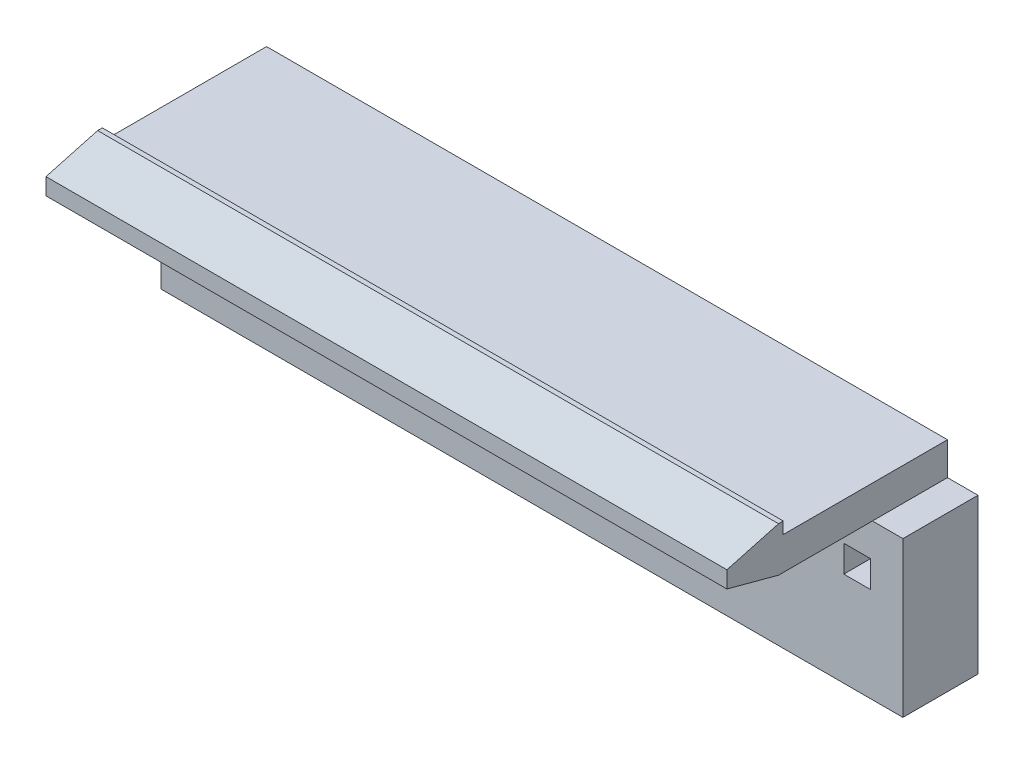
ISO-10303-21;
HEADER;
FILE_DESCRIPTION(('STEP AP214'),'2;1');
FILE_NAME('part.step','',(''),(''),'','','');
FILE_SCHEMA(('AUTOMOTIVE_DESIGN { 1 0 10303 214 1 1 1 1 }'));
ENDSEC;
DATA;
#1=APPLICATION_CONTEXT('core data for automotive mechanical design processes');
#2=APPLICATION_PROTOCOL_DEFINITION('international standard','automotive_design',2000,#1);
#3=PRODUCT_CONTEXT('',#1,'mechanical');
#4=PRODUCT('Part','Part','',(#3));
#5=PRODUCT_RELATED_PRODUCT_CATEGORY('part','',(#4));
#6=PRODUCT_DEFINITION_FORMATION('','',#4);
#7=PRODUCT_DEFINITION_CONTEXT('part definition',#1,'design');
#8=PRODUCT_DEFINITION('design','',#6,#7);
#9=PRODUCT_DEFINITION_SHAPE('','',#8);
#10=(LENGTH_UNIT() NAMED_UNIT(*) SI_UNIT(.MILLI.,.METRE.));
#11=(NAMED_UNIT(*) PLANE_ANGLE_UNIT() SI_UNIT($,.RADIAN.));
#12=(NAMED_UNIT(*) SI_UNIT($,.STERADIAN.) SOLID_ANGLE_UNIT());
#13=UNCERTAINTY_MEASURE_WITH_UNIT(LENGTH_MEASURE(1.E-05),#10,'distance_accuracy_value','');
#14=(GEOMETRIC_REPRESENTATION_CONTEXT(3) GLOBAL_UNCERTAINTY_ASSIGNED_CONTEXT((#13)) GLOBAL_UNIT_ASSIGNED_CONTEXT((#10,
#11,#12)) REPRESENTATION_CONTEXT('',''));
#15=CARTESIAN_POINT('',(0.,0.,0.));
#16=DIRECTION('',(0.,0.,1.));
#17=DIRECTION('',(1.,0.,0.));
#18=AXIS2_PLACEMENT_3D('',#15,#16,#17);
#19=CARTESIAN_POINT('',(0.,0.,9.4));
#20=DIRECTION('',(0.,0.,-1.));
#21=DIRECTION('',(-1.,0.,0.));
#22=AXIS2_PLACEMENT_3D('',#19,#20,#21);
#23=PLANE('',#22);
#24=DIRECTION('',(1.,0.,0.));
#25=VECTOR('',#24,1.);
#26=CARTESIAN_POINT('',(-15.81,2.93948822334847,9.4));
#27=LINE('',#26,#25);
#28=CARTESIAN_POINT('',(-14.51,2.93948822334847,9.4));
#29=VERTEX_POINT('',#28);
#30=CARTESIAN_POINT('',(14.51,2.93948822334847,9.4));
#31=VERTEX_POINT('',#30);
#32=EDGE_CURVE('E330',#29,#31,#27,.T.);
#33=ORIENTED_EDGE('',*,*,#32,.T.);
#34=DIRECTION('',(0.,1.,0.));
#35=VECTOR('',#34,1.);
#36=CARTESIAN_POINT('',(14.51,0.,9.4));
#37=LINE('',#36,#35);
#38=CARTESIAN_POINT('',(14.51,3.65,9.4));
#39=VERTEX_POINT('',#38);
#40=EDGE_CURVE('E19',#39,#31,#37,.F.);
#41=ORIENTED_EDGE('',*,*,#40,.F.);
#42=DIRECTION('',(1.,0.,0.));
#43=VECTOR('',#42,1.);
#44=CARTESIAN_POINT('',(0.,3.65,9.4));
#45=LINE('',#44,#43);
#46=CARTESIAN_POINT('',(-14.51,3.65,9.4));
#47=VERTEX_POINT('',#46);
#48=EDGE_CURVE('E335',#39,#47,#45,.F.);
#49=ORIENTED_EDGE('',*,*,#48,.T.);
#50=DIRECTION('',(0.,1.,0.));
#51=VECTOR('',#50,1.);
#52=CARTESIAN_POINT('',(-14.51,0.,9.4));
#53=LINE('',#52,#51);
#54=EDGE_CURVE('E311',#29,#47,#53,.T.);
#55=ORIENTED_EDGE('',*,*,#54,.F.);
#56=EDGE_LOOP('',(#33,#41,#49,#55));
#57=FACE_BOUND('',#56,.T.);
#58=ADVANCED_FACE('F16',(#57),#23,.F.);
#59=CARTESIAN_POINT('',(13.29,0.919999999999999,0.));
#60=DIRECTION('',(0.,1.,0.));
#61=DIRECTION('',(0.,0.,1.));
#62=AXIS2_PLACEMENT_3D('',#59,#60,#61);
#63=PLANE('',#62);
#64=DIRECTION('',(0.,0.,1.));
#65=VECTOR('',#64,1.);
#66=CARTESIAN_POINT('',(13.29,0.919999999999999,0.));
#67=LINE('',#66,#65);
#68=CARTESIAN_POINT('',(13.29,0.919999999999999,3.2));
#69=VERTEX_POINT('',#68);
#70=CARTESIAN_POINT('',(13.29,0.919999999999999,0.));
#71=VERTEX_POINT('',#70);
#72=EDGE_CURVE('E314',#69,#71,#67,.F.);
#73=ORIENTED_EDGE('',*,*,#72,.T.);
#74=DIRECTION('',(1.,0.,0.));
#75=VECTOR('',#74,1.);
#76=CARTESIAN_POINT('',(13.29,0.919999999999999,0.));
#77=LINE('',#76,#75);
#78=CARTESIAN_POINT('',(14.43,0.919999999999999,0.));
#79=VERTEX_POINT('',#78);
#80=EDGE_CURVE('E301',#79,#71,#77,.F.);
#81=ORIENTED_EDGE('',*,*,#80,.F.);
#82=DIRECTION('',(0.,0.,-1.));
#83=VECTOR('',#82,1.);
#84=CARTESIAN_POINT('',(14.43,0.919999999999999,0.));
#85=LINE('',#84,#83);
#86=CARTESIAN_POINT('',(14.43,0.919999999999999,3.2));
#87=VERTEX_POINT('',#86);
#88=EDGE_CURVE('E325',#79,#87,#85,.F.);
#89=ORIENTED_EDGE('',*,*,#88,.T.);
#90=DIRECTION('',(1.,0.,0.));
#91=VECTOR('',#90,1.);
#92=CARTESIAN_POINT('',(13.29,0.919999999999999,3.2));
#93=LINE('',#92,#91);
#94=EDGE_CURVE('E310',#69,#87,#93,.T.);
#95=ORIENTED_EDGE('',*,*,#94,.F.);
#96=EDGE_LOOP('',(#73,#81,#89,#95));
#97=FACE_BOUND('',#96,.T.);
#98=ADVANCED_FACE('F315',(#97),#63,.F.);
#99=CARTESIAN_POINT('',(9.32999999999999,0.919999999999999,0.));
#100=DIRECTION('',(0.,1.,0.));
#101=DIRECTION('',(0.,0.,1.));
#102=AXIS2_PLACEMENT_3D('',#99,#100,#101);
#103=PLANE('',#102);
#104=DIRECTION('',(0.,0.,1.));
#105=VECTOR('',#104,1.);
#106=CARTESIAN_POINT('',(9.32999999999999,0.919999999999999,0.));
#107=LINE('',#106,#105);
#108=CARTESIAN_POINT('',(9.32999999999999,0.919999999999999,3.2));
#109=VERTEX_POINT('',#108);
#110=CARTESIAN_POINT('',(9.32999999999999,0.919999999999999,0.));
#111=VERTEX_POINT('',#110);
#112=EDGE_CURVE('E468',#109,#111,#107,.F.);
#113=ORIENTED_EDGE('',*,*,#112,.T.);
#114=DIRECTION('',(1.,0.,0.));
#115=VECTOR('',#114,1.);
#116=CARTESIAN_POINT('',(9.32999999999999,0.919999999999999,0.));
#117=LINE('',#116,#115);
#118=CARTESIAN_POINT('',(10.47,0.919999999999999,0.));
#119=VERTEX_POINT('',#118);
#120=EDGE_CURVE('E366',#119,#111,#117,.F.);
#121=ORIENTED_EDGE('',*,*,#120,.F.);
#122=DIRECTION('',(0.,0.,-1.));
#123=VECTOR('',#122,1.);
#124=CARTESIAN_POINT('',(10.47,0.919999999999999,0.));
#125=LINE('',#124,#123);
#126=CARTESIAN_POINT('',(10.47,0.919999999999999,3.2));
#127=VERTEX_POINT('',#126);
#128=EDGE_CURVE('E461',#119,#127,#125,.F.);
#129=ORIENTED_EDGE('',*,*,#128,.T.);
#130=DIRECTION('',(1.,0.,0.));
#131=VECTOR('',#130,1.);
#132=CARTESIAN_POINT('',(9.32999999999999,0.919999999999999,3.2));
#133=LINE('',#132,#131);
#134=EDGE_CURVE('E364',#109,#127,#133,.T.);
#135=ORIENTED_EDGE('',*,*,#134,.F.);
#136=EDGE_LOOP('',(#113,#121,#129,#135));
#137=FACE_BOUND('',#136,.T.);
#138=ADVANCED_FACE('F648',(#137),#103,.F.);
#139=CARTESIAN_POINT('',(5.36999999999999,0.919999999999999,0.));
#140=DIRECTION('',(0.,1.,0.));
#141=DIRECTION('',(0.,0.,1.));
#142=AXIS2_PLACEMENT_3D('',#139,#140,#141);
#143=PLANE('',#142);
#144=DIRECTION('',(0.,0.,1.));
#145=VECTOR('',#144,1.);
#146=CARTESIAN_POINT('',(5.36999999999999,0.919999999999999,0.));
#147=LINE('',#146,#145);
#148=CARTESIAN_POINT('',(5.36999999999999,0.919999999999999,3.2));
#149=VERTEX_POINT('',#148);
#150=CARTESIAN_POINT('',(5.36999999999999,0.919999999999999,0.));
#151=VERTEX_POINT('',#150);
#152=EDGE_CURVE('E458',#149,#151,#147,.F.);
#153=ORIENTED_EDGE('',*,*,#152,.T.);
#154=DIRECTION('',(1.,0.,0.));
#155=VECTOR('',#154,1.);
#156=CARTESIAN_POINT('',(5.36999999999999,0.919999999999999,0.));
#157=LINE('',#156,#155);
#158=CARTESIAN_POINT('',(6.50999999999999,0.919999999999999,0.));
#159=VERTEX_POINT('',#158);
#160=EDGE_CURVE('E362',#159,#151,#157,.F.);
#161=ORIENTED_EDGE('',*,*,#160,.F.);
#162=DIRECTION('',(0.,0.,-1.));
#163=VECTOR('',#162,1.);
#164=CARTESIAN_POINT('',(6.50999999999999,0.919999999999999,0.));
#165=LINE('',#164,#163);
#166=CARTESIAN_POINT('',(6.50999999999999,0.919999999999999,3.2));
#167=VERTEX_POINT('',#166);
#168=EDGE_CURVE('E451',#159,#167,#165,.F.);
#169=ORIENTED_EDGE('',*,*,#168,.T.);
#170=DIRECTION('',(1.,0.,0.));
#171=VECTOR('',#170,1.);
#172=CARTESIAN_POINT('',(5.36999999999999,0.919999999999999,3.2));
#173=LINE('',#172,#171);
#174=EDGE_CURVE('E360',#149,#167,#173,.T.);
#175=ORIENTED_EDGE('',*,*,#174,.F.);
#176=EDGE_LOOP('',(#153,#161,#169,#175));
#177=FACE_BOUND('',#176,.T.);
#178=ADVANCED_FACE('F855',(#177),#143,.F.);
#179=CARTESIAN_POINT('',(1.40999999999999,0.919999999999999,0.));
#180=DIRECTION('',(0.,1.,0.));
#181=DIRECTION('',(0.,0.,1.));
#182=AXIS2_PLACEMENT_3D('',#179,#180,#181);
#183=PLANE('',#182);
#184=DIRECTION('',(0.,0.,1.));
#185=VECTOR('',#184,1.);
#186=CARTESIAN_POINT('',(1.40999999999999,0.919999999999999,0.));
#187=LINE('',#186,#185);
#188=CARTESIAN_POINT('',(1.40999999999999,0.919999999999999,3.2));
#189=VERTEX_POINT('',#188);
#190=CARTESIAN_POINT('',(1.40999999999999,0.919999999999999,0.));
#191=VERTEX_POINT('',#190);
#192=EDGE_CURVE('E448',#189,#191,#187,.F.);
#193=ORIENTED_EDGE('',*,*,#192,.T.);
#194=DIRECTION('',(1.,0.,0.));
#195=VECTOR('',#194,1.);
#196=CARTESIAN_POINT('',(1.40999999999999,0.919999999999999,0.));
#197=LINE('',#196,#195);
#198=CARTESIAN_POINT('',(2.54999999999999,0.919999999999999,0.));
#199=VERTEX_POINT('',#198);
#200=EDGE_CURVE('E358',#199,#191,#197,.F.);
#201=ORIENTED_EDGE('',*,*,#200,.F.);
#202=DIRECTION('',(0.,0.,-1.));
#203=VECTOR('',#202,1.);
#204=CARTESIAN_POINT('',(2.54999999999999,0.919999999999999,0.));
#205=LINE('',#204,#203);
#206=CARTESIAN_POINT('',(2.54999999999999,0.919999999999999,3.2));
#207=VERTEX_POINT('',#206);
#208=EDGE_CURVE('E441',#199,#207,#205,.F.);
#209=ORIENTED_EDGE('',*,*,#208,.T.);
#210=DIRECTION('',(1.,0.,0.));
#211=VECTOR('',#210,1.);
#212=CARTESIAN_POINT('',(1.40999999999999,0.919999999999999,3.2));
#213=LINE('',#212,#211);
#214=EDGE_CURVE('E356',#189,#207,#213,.T.);
#215=ORIENTED_EDGE('',*,*,#214,.F.);
#216=EDGE_LOOP('',(#193,#201,#209,#215));
#217=FACE_BOUND('',#216,.T.);
#218=ADVANCED_FACE('F719',(#217),#183,.F.);
#219=CARTESIAN_POINT('',(-2.55000000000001,0.919999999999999,0.));
#220=DIRECTION('',(0.,1.,0.));
#221=DIRECTION('',(0.,0.,1.));
#222=AXIS2_PLACEMENT_3D('',#219,#220,#221);
#223=PLANE('',#222);
#224=DIRECTION('',(0.,0.,1.));
#225=VECTOR('',#224,1.);
#226=CARTESIAN_POINT('',(-2.55000000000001,0.919999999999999,0.));
#227=LINE('',#226,#225);
#228=CARTESIAN_POINT('',(-2.55000000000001,0.919999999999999,3.2));
#229=VERTEX_POINT('',#228);
#230=CARTESIAN_POINT('',(-2.55000000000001,0.919999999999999,0.));
#231=VERTEX_POINT('',#230);
#232=EDGE_CURVE('E438',#229,#231,#227,.F.);
#233=ORIENTED_EDGE('',*,*,#232,.T.);
#234=DIRECTION('',(1.,0.,0.));
#235=VECTOR('',#234,1.);
#236=CARTESIAN_POINT('',(-2.55000000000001,0.919999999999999,0.));
#237=LINE('',#236,#235);
#238=CARTESIAN_POINT('',(-1.41000000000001,0.919999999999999,0.));
#239=VERTEX_POINT('',#238);
#240=EDGE_CURVE('E354',#239,#231,#237,.F.);
#241=ORIENTED_EDGE('',*,*,#240,.F.);
#242=DIRECTION('',(0.,0.,-1.));
#243=VECTOR('',#242,1.);
#244=CARTESIAN_POINT('',(-1.41000000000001,0.919999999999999,0.));
#245=LINE('',#244,#243);
#246=CARTESIAN_POINT('',(-1.41000000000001,0.919999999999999,3.2));
#247=VERTEX_POINT('',#246);
#248=EDGE_CURVE('E431',#239,#247,#245,.F.);
#249=ORIENTED_EDGE('',*,*,#248,.T.);
#250=DIRECTION('',(1.,0.,0.));
#251=VECTOR('',#250,1.);
#252=CARTESIAN_POINT('',(-2.55000000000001,0.919999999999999,3.2));
#253=LINE('',#252,#251);
#254=EDGE_CURVE('E352',#229,#247,#253,.T.);
#255=ORIENTED_EDGE('',*,*,#254,.F.);
#256=EDGE_LOOP('',(#233,#241,#249,#255));
#257=FACE_BOUND('',#256,.T.);
#258=ADVANCED_FACE('F842',(#257),#223,.F.);
#259=CARTESIAN_POINT('',(-6.51000000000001,0.919999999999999,0.));
#260=DIRECTION('',(0.,1.,0.));
#261=DIRECTION('',(0.,0.,1.));
#262=AXIS2_PLACEMENT_3D('',#259,#260,#261);
#263=PLANE('',#262);
#264=DIRECTION('',(0.,0.,1.));
#265=VECTOR('',#264,1.);
#266=CARTESIAN_POINT('',(-6.51000000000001,0.919999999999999,0.));
#267=LINE('',#266,#265);
#268=CARTESIAN_POINT('',(-6.51000000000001,0.919999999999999,3.2));
#269=VERTEX_POINT('',#268);
#270=CARTESIAN_POINT('',(-6.51000000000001,0.919999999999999,0.));
#271=VERTEX_POINT('',#270);
#272=EDGE_CURVE('E428',#269,#271,#267,.F.);
#273=ORIENTED_EDGE('',*,*,#272,.T.);
#274=DIRECTION('',(1.,0.,0.));
#275=VECTOR('',#274,1.);
#276=CARTESIAN_POINT('',(-6.51000000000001,0.919999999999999,0.));
#277=LINE('',#276,#275);
#278=CARTESIAN_POINT('',(-5.37000000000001,0.919999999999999,0.));
#279=VERTEX_POINT('',#278);
#280=EDGE_CURVE('E350',#279,#271,#277,.F.);
#281=ORIENTED_EDGE('',*,*,#280,.F.);
#282=DIRECTION('',(0.,0.,-1.));
#283=VECTOR('',#282,1.);
#284=CARTESIAN_POINT('',(-5.37000000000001,0.919999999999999,0.));
#285=LINE('',#284,#283);
#286=CARTESIAN_POINT('',(-5.37000000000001,0.919999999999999,3.2));
#287=VERTEX_POINT('',#286);
#288=EDGE_CURVE('E421',#279,#287,#285,.F.);
#289=ORIENTED_EDGE('',*,*,#288,.T.);
#290=DIRECTION('',(1.,0.,0.));
#291=VECTOR('',#290,1.);
#292=CARTESIAN_POINT('',(-6.51000000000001,0.919999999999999,3.2));
#293=LINE('',#292,#291);
#294=EDGE_CURVE('E348',#269,#287,#293,.T.);
#295=ORIENTED_EDGE('',*,*,#294,.F.);
#296=EDGE_LOOP('',(#273,#281,#289,#295));
#297=FACE_BOUND('',#296,.T.);
#298=ADVANCED_FACE('F846',(#297),#263,.F.);
#299=CARTESIAN_POINT('',(-10.47,0.919999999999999,0.));
#300=DIRECTION('',(0.,1.,0.));
#301=DIRECTION('',(0.,0.,1.));
#302=AXIS2_PLACEMENT_3D('',#299,#300,#301);
#303=PLANE('',#302);
#304=DIRECTION('',(0.,0.,1.));
#305=VECTOR('',#304,1.);
#306=CARTESIAN_POINT('',(-10.47,0.919999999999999,0.));
#307=LINE('',#306,#305);
#308=CARTESIAN_POINT('',(-10.47,0.919999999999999,3.2));
#309=VERTEX_POINT('',#308);
#310=CARTESIAN_POINT('',(-10.47,0.919999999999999,0.));
#311=VERTEX_POINT('',#310);
#312=EDGE_CURVE('E418',#309,#311,#307,.F.);
#313=ORIENTED_EDGE('',*,*,#312,.T.);
#314=DIRECTION('',(1.,0.,0.));
#315=VECTOR('',#314,1.);
#316=CARTESIAN_POINT('',(-10.47,0.919999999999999,0.));
#317=LINE('',#316,#315);
#318=CARTESIAN_POINT('',(-9.33000000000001,0.919999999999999,0.));
#319=VERTEX_POINT('',#318);
#320=EDGE_CURVE('E346',#319,#311,#317,.F.);
#321=ORIENTED_EDGE('',*,*,#320,.F.);
#322=DIRECTION('',(0.,0.,-1.));
#323=VECTOR('',#322,1.);
#324=CARTESIAN_POINT('',(-9.33000000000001,0.919999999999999,0.));
#325=LINE('',#324,#323);
#326=CARTESIAN_POINT('',(-9.33000000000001,0.919999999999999,3.2));
#327=VERTEX_POINT('',#326);
#328=EDGE_CURVE('E411',#319,#327,#325,.F.);
#329=ORIENTED_EDGE('',*,*,#328,.T.);
#330=DIRECTION('',(1.,0.,0.));
#331=VECTOR('',#330,1.);
#332=CARTESIAN_POINT('',(-10.47,0.919999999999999,3.2));
#333=LINE('',#332,#331);
#334=EDGE_CURVE('E344',#309,#327,#333,.T.);
#335=ORIENTED_EDGE('',*,*,#334,.F.);
#336=EDGE_LOOP('',(#313,#321,#329,#335));
#337=FACE_BOUND('',#336,.T.);
#338=ADVANCED_FACE('F852',(#337),#303,.F.);
#339=CARTESIAN_POINT('',(-14.43,0.919999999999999,0.));
#340=DIRECTION('',(0.,1.,0.));
#341=DIRECTION('',(0.,0.,1.));
#342=AXIS2_PLACEMENT_3D('',#339,#340,#341);
#343=PLANE('',#342);
#344=DIRECTION('',(0.,0.,1.));
#345=VECTOR('',#344,1.);
#346=CARTESIAN_POINT('',(-14.43,0.919999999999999,0.));
#347=LINE('',#346,#345);
#348=CARTESIAN_POINT('',(-14.43,0.919999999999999,3.2));
#349=VERTEX_POINT('',#348);
#350=CARTESIAN_POINT('',(-14.43,0.919999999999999,0.));
#351=VERTEX_POINT('',#350);
#352=EDGE_CURVE('E408',#349,#351,#347,.F.);
#353=ORIENTED_EDGE('',*,*,#352,.T.);
#354=DIRECTION('',(1.,0.,0.));
#355=VECTOR('',#354,1.);
#356=CARTESIAN_POINT('',(-14.43,0.919999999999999,0.));
#357=LINE('',#356,#355);
#358=CARTESIAN_POINT('',(-13.29,0.919999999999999,0.));
#359=VERTEX_POINT('',#358);
#360=EDGE_CURVE('E342',#359,#351,#357,.F.);
#361=ORIENTED_EDGE('',*,*,#360,.F.);
#362=DIRECTION('',(0.,0.,-1.));
#363=VECTOR('',#362,1.);
#364=CARTESIAN_POINT('',(-13.29,0.919999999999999,0.));
#365=LINE('',#364,#363);
#366=CARTESIAN_POINT('',(-13.29,0.919999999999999,3.2));
#367=VERTEX_POINT('',#366);
#368=EDGE_CURVE('E401',#359,#367,#365,.F.);
#369=ORIENTED_EDGE('',*,*,#368,.T.);
#370=DIRECTION('',(1.,0.,0.));
#371=VECTOR('',#370,1.);
#372=CARTESIAN_POINT('',(-14.43,0.919999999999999,3.2));
#373=LINE('',#372,#371);
#374=EDGE_CURVE('E340',#349,#367,#373,.T.);
#375=ORIENTED_EDGE('',*,*,#374,.F.);
#376=EDGE_LOOP('',(#353,#361,#369,#375));
#377=FACE_BOUND('',#376,.T.);
#378=ADVANCED_FACE('F920',(#377),#343,.F.);
#379=CARTESIAN_POINT('',(-15.81,4.25,9.4));
#380=DIRECTION('',(0.,-1.,0.));
#381=DIRECTION('',(0.,0.,-1.));
#382=AXIS2_PLACEMENT_3D('',#379,#380,#381);
#383=PLANE('',#382);
#384=DIRECTION('',(1.,0.,0.));
#385=VECTOR('',#384,1.);
#386=CARTESIAN_POINT('',(0.,4.25,7.19999999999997));
#387=LINE('',#386,#385);
#388=CARTESIAN_POINT('',(-14.51,4.25,7.19999999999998));
#389=VERTEX_POINT('',#388);
#390=CARTESIAN_POINT('',(14.51,4.25,7.19999999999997));
#391=VERTEX_POINT('',#390);
#392=EDGE_CURVE('E333',#389,#391,#387,.T.);
#393=ORIENTED_EDGE('',*,*,#392,.T.);
#394=DIRECTION('',(0.,0.,1.));
#395=VECTOR('',#394,1.);
#396=CARTESIAN_POINT('',(14.51,4.25,0.));
#397=LINE('',#396,#395);
#398=CARTESIAN_POINT('',(14.51,4.25,7.));
#399=VERTEX_POINT('',#398);
#400=EDGE_CURVE('E398',#391,#399,#397,.F.);
#401=ORIENTED_EDGE('',*,*,#400,.T.);
#402=DIRECTION('',(-1.,0.,0.));
#403=VECTOR('',#402,1.);
#404=CARTESIAN_POINT('',(0.,4.25,7.));
#405=LINE('',#404,#403);
#406=CARTESIAN_POINT('',(-14.51,4.25,7.));
#407=VERTEX_POINT('',#406);
#408=EDGE_CURVE('E391',#407,#399,#405,.F.);
#409=ORIENTED_EDGE('',*,*,#408,.F.);
#410=DIRECTION('',(0.,0.,-1.));
#411=VECTOR('',#410,1.);
#412=CARTESIAN_POINT('',(-14.51,4.25,9.4));
#413=LINE('',#412,#411);
#414=EDGE_CURVE('E338',#389,#407,#413,.T.);
#415=ORIENTED_EDGE('',*,*,#414,.F.);
#416=EDGE_LOOP('',(#393,#401,#409,#415));
#417=FACE_BOUND('',#416,.T.);
#418=ADVANCED_FACE('F516',(#417),#383,.F.);
#419=CARTESIAN_POINT('',(0.,3.65,9.4));
#420=DIRECTION('',(0.,-0.964763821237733,-0.263117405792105));
#421=DIRECTION('',(0.,0.263117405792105,-0.964763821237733));
#422=AXIS2_PLACEMENT_3D('',#419,#420,#421);
#423=PLANE('',#422);
#424=ORIENTED_EDGE('',*,*,#392,.F.);
#425=DIRECTION('',(0.,-0.263117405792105,0.964763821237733));
#426=VECTOR('',#425,1.);
#427=CARTESIAN_POINT('',(-14.51,4.25,7.19999999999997));
#428=LINE('',#427,#426);
#429=EDGE_CURVE('E501',#389,#47,#428,.T.);
#430=ORIENTED_EDGE('',*,*,#429,.T.);
#431=ORIENTED_EDGE('',*,*,#48,.F.);
#432=DIRECTION('',(0.,0.263117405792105,-0.964763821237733));
#433=VECTOR('',#432,1.);
#434=CARTESIAN_POINT('',(14.51,3.65,9.4));
#435=LINE('',#434,#433);
#436=EDGE_CURVE('E379',#39,#391,#435,.T.);
#437=ORIENTED_EDGE('',*,*,#436,.T.);
#438=EDGE_LOOP('',(#424,#430,#431,#437));
#439=FACE_BOUND('',#438,.T.);
#440=ADVANCED_FACE('F938',(#439),#423,.F.);
#441=CARTESIAN_POINT('',(-15.81,2.35,7.19999999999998));
#442=DIRECTION('',(0.,0.965925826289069,-0.258819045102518));
#443=DIRECTION('',(0.,0.258819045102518,0.965925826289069));
#444=AXIS2_PLACEMENT_3D('',#441,#442,#443);
#445=PLANE('',#444);
#446=ORIENTED_EDGE('',*,*,#32,.F.);
#447=DIRECTION('',(0.,-0.258819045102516,-0.96592582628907));
#448=VECTOR('',#447,1.);
#449=CARTESIAN_POINT('',(-14.51,2.93948822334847,9.4));
#450=LINE('',#449,#448);
#451=CARTESIAN_POINT('',(-14.51,2.34999999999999,7.19999999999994));
#452=VERTEX_POINT('',#451);
#453=EDGE_CURVE('E499',#29,#452,#450,.T.);
#454=ORIENTED_EDGE('',*,*,#453,.T.);
#455=DIRECTION('',(1.,0.,0.));
#456=VECTOR('',#455,1.);
#457=CARTESIAN_POINT('',(-15.81,2.35,7.19999999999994));
#458=LINE('',#457,#456);
#459=CARTESIAN_POINT('',(14.51,2.35,7.19999999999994));
#460=VERTEX_POINT('',#459);
#461=EDGE_CURVE('E318',#452,#460,#458,.T.);
#462=ORIENTED_EDGE('',*,*,#461,.T.);
#463=DIRECTION('',(0.,0.258819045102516,0.96592582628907));
#464=VECTOR('',#463,1.);
#465=CARTESIAN_POINT('',(14.51,2.34999999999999,7.19999999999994));
#466=LINE('',#465,#464);
#467=EDGE_CURVE('E376',#460,#31,#466,.T.);
#468=ORIENTED_EDGE('',*,*,#467,.T.);
#469=EDGE_LOOP('',(#446,#454,#462,#468));
#470=FACE_BOUND('',#469,.T.);
#471=ADVANCED_FACE('F384',(#470),#445,.F.);
#472=CARTESIAN_POINT('',(-15.81,2.35,3.2));
#473=DIRECTION('',(0.,1.,0.));
#474=DIRECTION('',(0.,0.,1.));
#475=AXIS2_PLACEMENT_3D('',#472,#473,#474);
#476=PLANE('',#475);
#477=ORIENTED_EDGE('',*,*,#461,.F.);
#478=DIRECTION('',(0.,0.,-1.));
#479=VECTOR('',#478,1.);
#480=CARTESIAN_POINT('',(-14.51,2.34999999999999,0.));
#481=LINE('',#480,#479);
#482=CARTESIAN_POINT('',(-14.51,2.35,3.2));
#483=VERTEX_POINT('',#482);
#484=EDGE_CURVE('E497',#452,#483,#481,.T.);
#485=ORIENTED_EDGE('',*,*,#484,.T.);
#486=DIRECTION('',(-1.,0.,0.));
#487=VECTOR('',#486,1.);
#488=CARTESIAN_POINT('',(0.,2.35,3.2));
#489=LINE('',#488,#487);
#490=CARTESIAN_POINT('',(14.51,2.35,3.2));
#491=VERTEX_POINT('',#490);
#492=EDGE_CURVE('E591',#483,#491,#489,.F.);
#493=ORIENTED_EDGE('',*,*,#492,.T.);
#494=DIRECTION('',(0.,0.,1.));
#495=VECTOR('',#494,1.);
#496=CARTESIAN_POINT('',(14.51,2.35,0.));
#497=LINE('',#496,#495);
#498=EDGE_CURVE('E388',#491,#460,#497,.T.);
#499=ORIENTED_EDGE('',*,*,#498,.T.);
#500=EDGE_LOOP('',(#477,#485,#493,#499));
#501=FACE_BOUND('',#500,.T.);
#502=ADVANCED_FACE('F956',(#501),#476,.F.);
#503=CARTESIAN_POINT('',(13.29,-0.22,0.));
#504=DIRECTION('',(-1.,0.,0.));
#505=DIRECTION('',(0.,0.,1.));
#506=AXIS2_PLACEMENT_3D('',#503,#504,#505);
#507=PLANE('',#506);
#508=DIRECTION('',(0.,0.,-1.));
#509=VECTOR('',#508,1.);
#510=CARTESIAN_POINT('',(13.29,-0.22,0.));
#511=LINE('',#510,#509);
#512=CARTESIAN_POINT('',(13.29,-0.22,3.2));
#513=VERTEX_POINT('',#512);
#514=CARTESIAN_POINT('',(13.29,-0.22,0.));
#515=VERTEX_POINT('',#514);
#516=EDGE_CURVE('E322',#513,#515,#511,.T.);
#517=ORIENTED_EDGE('',*,*,#516,.T.);
#518=DIRECTION('',(0.,1.,0.));
#519=VECTOR('',#518,1.);
#520=CARTESIAN_POINT('',(13.29,-0.22,0.));
#521=LINE('',#520,#519);
#522=EDGE_CURVE('E305',#71,#515,#521,.F.);
#523=ORIENTED_EDGE('',*,*,#522,.F.);
#524=ORIENTED_EDGE('',*,*,#72,.F.);
#525=DIRECTION('',(0.,1.,0.));
#526=VECTOR('',#525,1.);
#527=CARTESIAN_POINT('',(13.29,0.,3.2));
#528=LINE('',#527,#526);
#529=EDGE_CURVE('E481',#69,#513,#528,.F.);
#530=ORIENTED_EDGE('',*,*,#529,.T.);
#531=EDGE_LOOP('',(#517,#523,#524,#530));
#532=FACE_BOUND('',#531,.T.);
#533=ADVANCED_FACE('F320',(#532),#507,.F.);
#534=CARTESIAN_POINT('',(14.43,-0.22,0.));
#535=DIRECTION('',(1.,0.,0.));
#536=DIRECTION('',(0.,0.,-1.));
#537=AXIS2_PLACEMENT_3D('',#534,#535,#536);
#538=PLANE('',#537);
#539=ORIENTED_EDGE('',*,*,#88,.F.);
#540=DIRECTION('',(0.,1.,0.));
#541=VECTOR('',#540,1.);
#542=CARTESIAN_POINT('',(14.43,-0.22,0.));
#543=LINE('',#542,#541);
#544=CARTESIAN_POINT('',(14.43,-0.22,0.));
#545=VERTEX_POINT('',#544);
#546=EDGE_CURVE('E299',#545,#79,#543,.T.);
#547=ORIENTED_EDGE('',*,*,#546,.F.);
#548=DIRECTION('',(0.,0.,-1.));
#549=VECTOR('',#548,1.);
#550=CARTESIAN_POINT('',(14.43,-0.22,0.));
#551=LINE('',#550,#549);
#552=CARTESIAN_POINT('',(14.43,-0.22,3.2));
#553=VERTEX_POINT('',#552);
#554=EDGE_CURVE('E476',#545,#553,#551,.F.);
#555=ORIENTED_EDGE('',*,*,#554,.T.);
#556=DIRECTION('',(0.,1.,0.));
#557=VECTOR('',#556,1.);
#558=CARTESIAN_POINT('',(14.43,0.,3.2));
#559=LINE('',#558,#557);
#560=EDGE_CURVE('E473',#553,#87,#559,.T.);
#561=ORIENTED_EDGE('',*,*,#560,.T.);
#562=EDGE_LOOP('',(#539,#547,#555,#561));
#563=FACE_BOUND('',#562,.T.);
#564=ADVANCED_FACE('F474',(#563),#538,.F.);
#565=CARTESIAN_POINT('',(9.32999999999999,-0.22,0.));
#566=DIRECTION('',(-1.,0.,0.));
#567=DIRECTION('',(0.,0.,1.));
#568=AXIS2_PLACEMENT_3D('',#565,#566,#567);
#569=PLANE('',#568);
#570=DIRECTION('',(0.,0.,-1.));
#571=VECTOR('',#570,1.);
#572=CARTESIAN_POINT('',(9.32999999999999,-0.22,0.));
#573=LINE('',#572,#571);
#574=CARTESIAN_POINT('',(9.32999999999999,-0.22,3.2));
#575=VERTEX_POINT('',#574);
#576=CARTESIAN_POINT('',(9.32999999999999,-0.22,0.));
#577=VERTEX_POINT('',#576);
#578=EDGE_CURVE('E582',#575,#577,#573,.T.);
#579=ORIENTED_EDGE('',*,*,#578,.T.);
#580=DIRECTION('',(0.,1.,0.));
#581=VECTOR('',#580,1.);
#582=CARTESIAN_POINT('',(9.32999999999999,-0.22,0.));
#583=LINE('',#582,#581);
#584=EDGE_CURVE('E466',#111,#577,#583,.F.);
#585=ORIENTED_EDGE('',*,*,#584,.F.);
#586=ORIENTED_EDGE('',*,*,#112,.F.);
#587=DIRECTION('',(0.,1.,0.));
#588=VECTOR('',#587,1.);
#589=CARTESIAN_POINT('',(9.32999999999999,0.,3.2));
#590=LINE('',#589,#588);
#591=EDGE_CURVE('E480',#109,#575,#590,.F.);
#592=ORIENTED_EDGE('',*,*,#591,.T.);
#593=EDGE_LOOP('',(#579,#585,#586,#592));
#594=FACE_BOUND('',#593,.T.);
#595=ADVANCED_FACE('F644',(#594),#569,.F.);
#596=CARTESIAN_POINT('',(10.47,-0.22,0.));
#597=DIRECTION('',(1.,0.,0.));
#598=DIRECTION('',(0.,0.,-1.));
#599=AXIS2_PLACEMENT_3D('',#596,#597,#598);
#600=PLANE('',#599);
#601=ORIENTED_EDGE('',*,*,#128,.F.);
#602=DIRECTION('',(0.,1.,0.));
#603=VECTOR('',#602,1.);
#604=CARTESIAN_POINT('',(10.47,-0.22,0.));
#605=LINE('',#604,#603);
#606=CARTESIAN_POINT('',(10.47,-0.22,0.));
#607=VERTEX_POINT('',#606);
#608=EDGE_CURVE('E464',#607,#119,#605,.T.);
#609=ORIENTED_EDGE('',*,*,#608,.F.);
#610=DIRECTION('',(0.,0.,-1.));
#611=VECTOR('',#610,1.);
#612=CARTESIAN_POINT('',(10.47,-0.22,0.));
#613=LINE('',#612,#611);
#614=CARTESIAN_POINT('',(10.47,-0.22,3.2));
#615=VERTEX_POINT('',#614);
#616=EDGE_CURVE('E580',#607,#615,#613,.F.);
#617=ORIENTED_EDGE('',*,*,#616,.T.);
#618=DIRECTION('',(0.,1.,0.));
#619=VECTOR('',#618,1.);
#620=CARTESIAN_POINT('',(10.47,0.,3.2));
#621=LINE('',#620,#619);
#622=EDGE_CURVE('E483',#615,#127,#621,.T.);
#623=ORIENTED_EDGE('',*,*,#622,.T.);
#624=EDGE_LOOP('',(#601,#609,#617,#623));
#625=FACE_BOUND('',#624,.T.);
#626=ADVANCED_FACE('F630',(#625),#600,.F.);
#627=CARTESIAN_POINT('',(5.36999999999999,-0.22,0.));
#628=DIRECTION('',(-1.,0.,0.));
#629=DIRECTION('',(0.,0.,1.));
#630=AXIS2_PLACEMENT_3D('',#627,#628,#629);
#631=PLANE('',#630);
#632=DIRECTION('',(0.,0.,-1.));
#633=VECTOR('',#632,1.);
#634=CARTESIAN_POINT('',(5.36999999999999,-0.22,0.));
#635=LINE('',#634,#633);
#636=CARTESIAN_POINT('',(5.36999999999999,-0.22,3.2));
#637=VERTEX_POINT('',#636);
#638=CARTESIAN_POINT('',(5.36999999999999,-0.22,0.));
#639=VERTEX_POINT('',#638);
#640=EDGE_CURVE('E574',#637,#639,#635,.T.);
#641=ORIENTED_EDGE('',*,*,#640,.T.);
#642=DIRECTION('',(0.,1.,0.));
#643=VECTOR('',#642,1.);
#644=CARTESIAN_POINT('',(5.36999999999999,-0.22,0.));
#645=LINE('',#644,#643);
#646=EDGE_CURVE('E456',#151,#639,#645,.F.);
#647=ORIENTED_EDGE('',*,*,#646,.F.);
#648=ORIENTED_EDGE('',*,*,#152,.F.);
#649=DIRECTION('',(0.,1.,0.));
#650=VECTOR('',#649,1.);
#651=CARTESIAN_POINT('',(5.36999999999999,0.,3.2));
#652=LINE('',#651,#650);
#653=EDGE_CURVE('E625',#149,#637,#652,.F.);
#654=ORIENTED_EDGE('',*,*,#653,.T.);
#655=EDGE_LOOP('',(#641,#647,#648,#654));
#656=FACE_BOUND('',#655,.T.);
#657=ADVANCED_FACE('F732',(#656),#631,.F.);
#658=CARTESIAN_POINT('',(6.50999999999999,-0.22,0.));
#659=DIRECTION('',(1.,0.,0.));
#660=DIRECTION('',(0.,0.,-1.));
#661=AXIS2_PLACEMENT_3D('',#658,#659,#660);
#662=PLANE('',#661);
#663=ORIENTED_EDGE('',*,*,#168,.F.);
#664=DIRECTION('',(0.,1.,0.));
#665=VECTOR('',#664,1.);
#666=CARTESIAN_POINT('',(6.50999999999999,-0.22,0.));
#667=LINE('',#666,#665);
#668=CARTESIAN_POINT('',(6.50999999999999,-0.22,0.));
#669=VERTEX_POINT('',#668);
#670=EDGE_CURVE('E454',#669,#159,#667,.T.);
#671=ORIENTED_EDGE('',*,*,#670,.F.);
#672=DIRECTION('',(0.,0.,-1.));
#673=VECTOR('',#672,1.);
#674=CARTESIAN_POINT('',(6.50999999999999,-0.22,0.));
#675=LINE('',#674,#673);
#676=CARTESIAN_POINT('',(6.50999999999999,-0.22,3.2));
#677=VERTEX_POINT('',#676);
#678=EDGE_CURVE('E572',#669,#677,#675,.F.);
#679=ORIENTED_EDGE('',*,*,#678,.T.);
#680=DIRECTION('',(0.,1.,0.));
#681=VECTOR('',#680,1.);
#682=CARTESIAN_POINT('',(6.50999999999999,0.,3.2));
#683=LINE('',#682,#681);
#684=EDGE_CURVE('E622',#677,#167,#683,.T.);
#685=ORIENTED_EDGE('',*,*,#684,.T.);
#686=EDGE_LOOP('',(#663,#671,#679,#685));
#687=FACE_BOUND('',#686,.T.);
#688=ADVANCED_FACE('F723',(#687),#662,.F.);
#689=CARTESIAN_POINT('',(1.40999999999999,-0.22,0.));
#690=DIRECTION('',(-1.,0.,0.));
#691=DIRECTION('',(0.,0.,1.));
#692=AXIS2_PLACEMENT_3D('',#689,#690,#691);
#693=PLANE('',#692);
#694=DIRECTION('',(0.,0.,-1.));
#695=VECTOR('',#694,1.);
#696=CARTESIAN_POINT('',(1.40999999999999,-0.22,0.));
#697=LINE('',#696,#695);
#698=CARTESIAN_POINT('',(1.40999999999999,-0.22,3.2));
#699=VERTEX_POINT('',#698);
#700=CARTESIAN_POINT('',(1.40999999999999,-0.22,0.));
#701=VERTEX_POINT('',#700);
#702=EDGE_CURVE('E566',#699,#701,#697,.T.);
#703=ORIENTED_EDGE('',*,*,#702,.T.);
#704=DIRECTION('',(0.,1.,0.));
#705=VECTOR('',#704,1.);
#706=CARTESIAN_POINT('',(1.40999999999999,-0.22,0.));
#707=LINE('',#706,#705);
#708=EDGE_CURVE('E446',#191,#701,#707,.F.);
#709=ORIENTED_EDGE('',*,*,#708,.F.);
#710=ORIENTED_EDGE('',*,*,#192,.F.);
#711=DIRECTION('',(0.,1.,0.));
#712=VECTOR('',#711,1.);
#713=CARTESIAN_POINT('',(1.40999999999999,0.,3.2));
#714=LINE('',#713,#712);
#715=EDGE_CURVE('E620',#189,#699,#714,.F.);
#716=ORIENTED_EDGE('',*,*,#715,.T.);
#717=EDGE_LOOP('',(#703,#709,#710,#716));
#718=FACE_BOUND('',#717,.T.);
#719=ADVANCED_FACE('F721',(#718),#693,.F.);
#720=CARTESIAN_POINT('',(2.54999999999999,-0.22,0.));
#721=DIRECTION('',(1.,0.,0.));
#722=DIRECTION('',(0.,0.,-1.));
#723=AXIS2_PLACEMENT_3D('',#720,#721,#722);
#724=PLANE('',#723);
#725=ORIENTED_EDGE('',*,*,#208,.F.);
#726=DIRECTION('',(0.,1.,0.));
#727=VECTOR('',#726,1.);
#728=CARTESIAN_POINT('',(2.54999999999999,-0.22,0.));
#729=LINE('',#728,#727);
#730=CARTESIAN_POINT('',(2.54999999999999,-0.22,0.));
#731=VERTEX_POINT('',#730);
#732=EDGE_CURVE('E444',#731,#199,#729,.T.);
#733=ORIENTED_EDGE('',*,*,#732,.F.);
#734=DIRECTION('',(0.,0.,-1.));
#735=VECTOR('',#734,1.);
#736=CARTESIAN_POINT('',(2.54999999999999,-0.22,0.));
#737=LINE('',#736,#735);
#738=CARTESIAN_POINT('',(2.54999999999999,-0.22,3.2));
#739=VERTEX_POINT('',#738);
#740=EDGE_CURVE('E564',#731,#739,#737,.F.);
#741=ORIENTED_EDGE('',*,*,#740,.T.);
#742=DIRECTION('',(0.,1.,0.));
#743=VECTOR('',#742,1.);
#744=CARTESIAN_POINT('',(2.54999999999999,0.,3.2));
#745=LINE('',#744,#743);
#746=EDGE_CURVE('E617',#739,#207,#745,.T.);
#747=ORIENTED_EDGE('',*,*,#746,.T.);
#748=EDGE_LOOP('',(#725,#733,#741,#747));
#749=FACE_BOUND('',#748,.T.);
#750=ADVANCED_FACE('F713',(#749),#724,.F.);
#751=CARTESIAN_POINT('',(-2.55000000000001,-0.22,0.));
#752=DIRECTION('',(-1.,0.,0.));
#753=DIRECTION('',(0.,0.,1.));
#754=AXIS2_PLACEMENT_3D('',#751,#752,#753);
#755=PLANE('',#754);
#756=DIRECTION('',(0.,0.,-1.));
#757=VECTOR('',#756,1.);
#758=CARTESIAN_POINT('',(-2.55000000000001,-0.22,0.));
#759=LINE('',#758,#757);
#760=CARTESIAN_POINT('',(-2.55000000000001,-0.22,3.2));
#761=VERTEX_POINT('',#760);
#762=CARTESIAN_POINT('',(-2.55000000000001,-0.22,0.));
#763=VERTEX_POINT('',#762);
#764=EDGE_CURVE('E558',#761,#763,#759,.T.);
#765=ORIENTED_EDGE('',*,*,#764,.T.);
#766=DIRECTION('',(0.,1.,0.));
#767=VECTOR('',#766,1.);
#768=CARTESIAN_POINT('',(-2.55000000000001,-0.22,0.));
#769=LINE('',#768,#767);
#770=EDGE_CURVE('E436',#231,#763,#769,.F.);
#771=ORIENTED_EDGE('',*,*,#770,.F.);
#772=ORIENTED_EDGE('',*,*,#232,.F.);
#773=DIRECTION('',(0.,1.,0.));
#774=VECTOR('',#773,1.);
#775=CARTESIAN_POINT('',(-2.55000000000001,0.,3.2));
#776=LINE('',#775,#774);
#777=EDGE_CURVE('E615',#229,#761,#776,.F.);
#778=ORIENTED_EDGE('',*,*,#777,.T.);
#779=EDGE_LOOP('',(#765,#771,#772,#778));
#780=FACE_BOUND('',#779,.T.);
#781=ADVANCED_FACE('F730',(#780),#755,.F.);
#782=CARTESIAN_POINT('',(-1.41000000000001,-0.22,0.));
#783=DIRECTION('',(1.,0.,0.));
#784=DIRECTION('',(0.,0.,-1.));
#785=AXIS2_PLACEMENT_3D('',#782,#783,#784);
#786=PLANE('',#785);
#787=ORIENTED_EDGE('',*,*,#248,.F.);
#788=DIRECTION('',(0.,1.,0.));
#789=VECTOR('',#788,1.);
#790=CARTESIAN_POINT('',(-1.41000000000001,-0.22,0.));
#791=LINE('',#790,#789);
#792=CARTESIAN_POINT('',(-1.41000000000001,-0.22,0.));
#793=VERTEX_POINT('',#792);
#794=EDGE_CURVE('E434',#793,#239,#791,.T.);
#795=ORIENTED_EDGE('',*,*,#794,.F.);
#796=DIRECTION('',(0.,0.,-1.));
#797=VECTOR('',#796,1.);
#798=CARTESIAN_POINT('',(-1.41000000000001,-0.22,0.));
#799=LINE('',#798,#797);
#800=CARTESIAN_POINT('',(-1.41000000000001,-0.22,3.2));
#801=VERTEX_POINT('',#800);
#802=EDGE_CURVE('E556',#793,#801,#799,.F.);
#803=ORIENTED_EDGE('',*,*,#802,.T.);
#804=DIRECTION('',(0.,1.,0.));
#805=VECTOR('',#804,1.);
#806=CARTESIAN_POINT('',(-1.41000000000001,0.,3.2));
#807=LINE('',#806,#805);
#808=EDGE_CURVE('E612',#801,#247,#807,.T.);
#809=ORIENTED_EDGE('',*,*,#808,.T.);
#810=EDGE_LOOP('',(#787,#795,#803,#809));
#811=FACE_BOUND('',#810,.T.);
#812=ADVANCED_FACE('F822',(#811),#786,.F.);
#813=CARTESIAN_POINT('',(-6.51000000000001,-0.22,0.));
#814=DIRECTION('',(-1.,0.,0.));
#815=DIRECTION('',(0.,0.,1.));
#816=AXIS2_PLACEMENT_3D('',#813,#814,#815);
#817=PLANE('',#816);
#818=DIRECTION('',(0.,0.,-1.));
#819=VECTOR('',#818,1.);
#820=CARTESIAN_POINT('',(-6.51000000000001,-0.22,0.));
#821=LINE('',#820,#819);
#822=CARTESIAN_POINT('',(-6.51000000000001,-0.22,3.2));
#823=VERTEX_POINT('',#822);
#824=CARTESIAN_POINT('',(-6.51000000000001,-0.22,0.));
#825=VERTEX_POINT('',#824);
#826=EDGE_CURVE('E550',#823,#825,#821,.T.);
#827=ORIENTED_EDGE('',*,*,#826,.T.);
#828=DIRECTION('',(0.,1.,0.));
#829=VECTOR('',#828,1.);
#830=CARTESIAN_POINT('',(-6.51000000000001,-0.22,0.));
#831=LINE('',#830,#829);
#832=EDGE_CURVE('E426',#271,#825,#831,.F.);
#833=ORIENTED_EDGE('',*,*,#832,.F.);
#834=ORIENTED_EDGE('',*,*,#272,.F.);
#835=DIRECTION('',(0.,1.,0.));
#836=VECTOR('',#835,1.);
#837=CARTESIAN_POINT('',(-6.51000000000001,0.,3.2));
#838=LINE('',#837,#836);
#839=EDGE_CURVE('E610',#269,#823,#838,.F.);
#840=ORIENTED_EDGE('',*,*,#839,.T.);
#841=EDGE_LOOP('',(#827,#833,#834,#840));
#842=FACE_BOUND('',#841,.T.);
#843=ADVANCED_FACE('F818',(#842),#817,.F.);
#844=CARTESIAN_POINT('',(-5.37000000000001,-0.22,0.));
#845=DIRECTION('',(1.,0.,0.));
#846=DIRECTION('',(0.,0.,-1.));
#847=AXIS2_PLACEMENT_3D('',#844,#845,#846);
#848=PLANE('',#847);
#849=ORIENTED_EDGE('',*,*,#288,.F.);
#850=DIRECTION('',(0.,1.,0.));
#851=VECTOR('',#850,1.);
#852=CARTESIAN_POINT('',(-5.37000000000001,-0.22,0.));
#853=LINE('',#852,#851);
#854=CARTESIAN_POINT('',(-5.37000000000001,-0.22,0.));
#855=VERTEX_POINT('',#854);
#856=EDGE_CURVE('E424',#855,#279,#853,.T.);
#857=ORIENTED_EDGE('',*,*,#856,.F.);
#858=DIRECTION('',(0.,0.,-1.));
#859=VECTOR('',#858,1.);
#860=CARTESIAN_POINT('',(-5.37000000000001,-0.22,0.));
#861=LINE('',#860,#859);
#862=CARTESIAN_POINT('',(-5.37000000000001,-0.22,3.2));
#863=VERTEX_POINT('',#862);
#864=EDGE_CURVE('E548',#855,#863,#861,.F.);
#865=ORIENTED_EDGE('',*,*,#864,.T.);
#866=DIRECTION('',(0.,1.,0.));
#867=VECTOR('',#866,1.);
#868=CARTESIAN_POINT('',(-5.37000000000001,0.,3.2));
#869=LINE('',#868,#867);
#870=EDGE_CURVE('E607',#863,#287,#869,.T.);
#871=ORIENTED_EDGE('',*,*,#870,.T.);
#872=EDGE_LOOP('',(#849,#857,#865,#871));
#873=FACE_BOUND('',#872,.T.);
#874=ADVANCED_FACE('F814',(#873),#848,.F.);
#875=CARTESIAN_POINT('',(-10.47,-0.22,0.));
#876=DIRECTION('',(-1.,0.,0.));
#877=DIRECTION('',(0.,0.,1.));
#878=AXIS2_PLACEMENT_3D('',#875,#876,#877);
#879=PLANE('',#878);
#880=DIRECTION('',(0.,0.,-1.));
#881=VECTOR('',#880,1.);
#882=CARTESIAN_POINT('',(-10.47,-0.22,0.));
#883=LINE('',#882,#881);
#884=CARTESIAN_POINT('',(-10.47,-0.22,3.2));
#885=VERTEX_POINT('',#884);
#886=CARTESIAN_POINT('',(-10.47,-0.22,0.));
#887=VERTEX_POINT('',#886);
#888=EDGE_CURVE('E542',#885,#887,#883,.T.);
#889=ORIENTED_EDGE('',*,*,#888,.T.);
#890=DIRECTION('',(0.,1.,0.));
#891=VECTOR('',#890,1.);
#892=CARTESIAN_POINT('',(-10.47,-0.22,0.));
#893=LINE('',#892,#891);
#894=EDGE_CURVE('E416',#311,#887,#893,.F.);
#895=ORIENTED_EDGE('',*,*,#894,.F.);
#896=ORIENTED_EDGE('',*,*,#312,.F.);
#897=DIRECTION('',(0.,1.,0.));
#898=VECTOR('',#897,1.);
#899=CARTESIAN_POINT('',(-10.47,0.,3.2));
#900=LINE('',#899,#898);
#901=EDGE_CURVE('E605',#309,#885,#900,.F.);
#902=ORIENTED_EDGE('',*,*,#901,.T.);
#903=EDGE_LOOP('',(#889,#895,#896,#902));
#904=FACE_BOUND('',#903,.T.);
#905=ADVANCED_FACE('F810',(#904),#879,.F.);
#906=CARTESIAN_POINT('',(-9.33000000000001,-0.22,0.));
#907=DIRECTION('',(1.,0.,0.));
#908=DIRECTION('',(0.,0.,-1.));
#909=AXIS2_PLACEMENT_3D('',#906,#907,#908);
#910=PLANE('',#909);
#911=ORIENTED_EDGE('',*,*,#328,.F.);
#912=DIRECTION('',(0.,1.,0.));
#913=VECTOR('',#912,1.);
#914=CARTESIAN_POINT('',(-9.33000000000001,-0.22,0.));
#915=LINE('',#914,#913);
#916=CARTESIAN_POINT('',(-9.33000000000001,-0.22,0.));
#917=VERTEX_POINT('',#916);
#918=EDGE_CURVE('E414',#917,#319,#915,.T.);
#919=ORIENTED_EDGE('',*,*,#918,.F.);
#920=DIRECTION('',(0.,0.,-1.));
#921=VECTOR('',#920,1.);
#922=CARTESIAN_POINT('',(-9.33000000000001,-0.22,0.));
#923=LINE('',#922,#921);
#924=CARTESIAN_POINT('',(-9.33000000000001,-0.22,3.2));
#925=VERTEX_POINT('',#924);
#926=EDGE_CURVE('E540',#917,#925,#923,.F.);
#927=ORIENTED_EDGE('',*,*,#926,.T.);
#928=DIRECTION('',(0.,1.,0.));
#929=VECTOR('',#928,1.);
#930=CARTESIAN_POINT('',(-9.33000000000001,0.,3.2));
#931=LINE('',#930,#929);
#932=EDGE_CURVE('E602',#925,#327,#931,.T.);
#933=ORIENTED_EDGE('',*,*,#932,.T.);
#934=EDGE_LOOP('',(#911,#919,#927,#933));
#935=FACE_BOUND('',#934,.T.);
#936=ADVANCED_FACE('F806',(#935),#910,.F.);
#937=CARTESIAN_POINT('',(-14.43,-0.22,0.));
#938=DIRECTION('',(-1.,0.,0.));
#939=DIRECTION('',(0.,0.,1.));
#940=AXIS2_PLACEMENT_3D('',#937,#938,#939);
#941=PLANE('',#940);
#942=DIRECTION('',(0.,0.,-1.));
#943=VECTOR('',#942,1.);
#944=CARTESIAN_POINT('',(-14.43,-0.22,0.));
#945=LINE('',#944,#943);
#946=CARTESIAN_POINT('',(-14.43,-0.22,3.2));
#947=VERTEX_POINT('',#946);
#948=CARTESIAN_POINT('',(-14.43,-0.22,0.));
#949=VERTEX_POINT('',#948);
#950=EDGE_CURVE('E534',#947,#949,#945,.T.);
#951=ORIENTED_EDGE('',*,*,#950,.T.);
#952=DIRECTION('',(0.,1.,0.));
#953=VECTOR('',#952,1.);
#954=CARTESIAN_POINT('',(-14.43,-0.22,0.));
#955=LINE('',#954,#953);
#956=EDGE_CURVE('E406',#351,#949,#955,.F.);
#957=ORIENTED_EDGE('',*,*,#956,.F.);
#958=ORIENTED_EDGE('',*,*,#352,.F.);
#959=DIRECTION('',(0.,1.,0.));
#960=VECTOR('',#959,1.);
#961=CARTESIAN_POINT('',(-14.43,0.,3.2));
#962=LINE('',#961,#960);
#963=EDGE_CURVE('E600',#349,#947,#962,.F.);
#964=ORIENTED_EDGE('',*,*,#963,.T.);
#965=EDGE_LOOP('',(#951,#957,#958,#964));
#966=FACE_BOUND('',#965,.T.);
#967=ADVANCED_FACE('F802',(#966),#941,.F.);
#968=CARTESIAN_POINT('',(-13.29,-0.22,0.));
#969=DIRECTION('',(1.,0.,0.));
#970=DIRECTION('',(0.,0.,-1.));
#971=AXIS2_PLACEMENT_3D('',#968,#969,#970);
#972=PLANE('',#971);
#973=ORIENTED_EDGE('',*,*,#368,.F.);
#974=DIRECTION('',(0.,1.,0.));
#975=VECTOR('',#974,1.);
#976=CARTESIAN_POINT('',(-13.29,-0.22,0.));
#977=LINE('',#976,#975);
#978=CARTESIAN_POINT('',(-13.29,-0.22,0.));
#979=VERTEX_POINT('',#978);
#980=EDGE_CURVE('E404',#979,#359,#977,.T.);
#981=ORIENTED_EDGE('',*,*,#980,.F.);
#982=DIRECTION('',(0.,0.,-1.));
#983=VECTOR('',#982,1.);
#984=CARTESIAN_POINT('',(-13.29,-0.22,0.));
#985=LINE('',#984,#983);
#986=CARTESIAN_POINT('',(-13.29,-0.22,3.2));
#987=VERTEX_POINT('',#986);
#988=EDGE_CURVE('E529',#979,#987,#985,.F.);
#989=ORIENTED_EDGE('',*,*,#988,.T.);
#990=DIRECTION('',(0.,1.,0.));
#991=VECTOR('',#990,1.);
#992=CARTESIAN_POINT('',(-13.29,0.,3.2));
#993=LINE('',#992,#991);
#994=EDGE_CURVE('E597',#987,#367,#993,.T.);
#995=ORIENTED_EDGE('',*,*,#994,.T.);
#996=EDGE_LOOP('',(#973,#981,#989,#995));
#997=FACE_BOUND('',#996,.T.);
#998=ADVANCED_FACE('F799',(#997),#972,.F.);
#999=CARTESIAN_POINT('',(14.51,4.25,0.));
#1000=DIRECTION('',(-1.,0.,0.));
#1001=DIRECTION('',(0.,0.,1.));
#1002=AXIS2_PLACEMENT_3D('',#999,#1000,#1001);
#1003=PLANE('',#1002);
#1004=ORIENTED_EDGE('',*,*,#467,.F.);
#1005=ORIENTED_EDGE('',*,*,#498,.F.);
#1006=DIRECTION('',(0.,0.,-1.));
#1007=VECTOR('',#1006,1.);
#1008=CARTESIAN_POINT('',(14.51,2.35,0.));
#1009=LINE('',#1008,#1007);
#1010=CARTESIAN_POINT('',(14.51,2.35,0.));
#1011=VERTEX_POINT('',#1010);
#1012=EDGE_CURVE('E494',#491,#1011,#1009,.T.);
#1013=ORIENTED_EDGE('',*,*,#1012,.T.);
#1014=DIRECTION('',(0.,1.,0.));
#1015=VECTOR('',#1014,1.);
#1016=CARTESIAN_POINT('',(14.51,4.25,0.));
#1017=LINE('',#1016,#1015);
#1018=CARTESIAN_POINT('',(14.51,3.75,0.));
#1019=VERTEX_POINT('',#1018);
#1020=EDGE_CURVE('E393',#1019,#1011,#1017,.F.);
#1021=ORIENTED_EDGE('',*,*,#1020,.F.);
#1022=DIRECTION('',(0.,0.,-1.));
#1023=VECTOR('',#1022,1.);
#1024=CARTESIAN_POINT('',(14.51,3.75,7.));
#1025=LINE('',#1024,#1023);
#1026=CARTESIAN_POINT('',(14.51,3.75,7.));
#1027=VERTEX_POINT('',#1026);
#1028=EDGE_CURVE('E519',#1019,#1027,#1025,.F.);
#1029=ORIENTED_EDGE('',*,*,#1028,.T.);
#1030=DIRECTION('',(0.,1.,0.));
#1031=VECTOR('',#1030,1.);
#1032=CARTESIAN_POINT('',(14.51,0.,7.));
#1033=LINE('',#1032,#1031);
#1034=EDGE_CURVE('E387',#399,#1027,#1033,.F.);
#1035=ORIENTED_EDGE('',*,*,#1034,.F.);
#1036=ORIENTED_EDGE('',*,*,#400,.F.);
#1037=ORIENTED_EDGE('',*,*,#436,.F.);
#1038=ORIENTED_EDGE('',*,*,#40,.T.);
#1039=EDGE_LOOP('',(#1004,#1005,#1013,#1021,#1029,#1035,#1036,#1037,#1038));
#1040=FACE_BOUND('',#1039,.T.);
#1041=ADVANCED_FACE('F374',(#1040),#1003,.F.);
#1042=CARTESIAN_POINT('',(0.,0.,7.));
#1043=DIRECTION('',(0.,0.,-1.));
#1044=DIRECTION('',(-1.,0.,0.));
#1045=AXIS2_PLACEMENT_3D('',#1042,#1043,#1044);
#1046=PLANE('',#1045);
#1047=DIRECTION('',(0.,1.,0.));
#1048=VECTOR('',#1047,1.);
#1049=CARTESIAN_POINT('',(-14.51,4.25,7.));
#1050=LINE('',#1049,#1048);
#1051=CARTESIAN_POINT('',(-14.51,3.75,7.));
#1052=VERTEX_POINT('',#1051);
#1053=EDGE_CURVE('E504',#1052,#407,#1050,.T.);
#1054=ORIENTED_EDGE('',*,*,#1053,.T.);
#1055=ORIENTED_EDGE('',*,*,#408,.T.);
#1056=ORIENTED_EDGE('',*,*,#1034,.T.);
#1057=DIRECTION('',(1.,0.,0.));
#1058=VECTOR('',#1057,1.);
#1059=CARTESIAN_POINT('',(14.51,3.75,7.));
#1060=LINE('',#1059,#1058);
#1061=EDGE_CURVE('E523',#1027,#1052,#1060,.F.);
#1062=ORIENTED_EDGE('',*,*,#1061,.T.);
#1063=EDGE_LOOP('',(#1054,#1055,#1056,#1062));
#1064=FACE_BOUND('',#1063,.T.);
#1065=ADVANCED_FACE('F511',(#1064),#1046,.T.);
#1066=CARTESIAN_POINT('',(-14.51,4.25,0.));
#1067=DIRECTION('',(1.,0.,0.));
#1068=DIRECTION('',(0.,0.,-1.));
#1069=AXIS2_PLACEMENT_3D('',#1066,#1067,#1068);
#1070=PLANE('',#1069);
#1071=ORIENTED_EDGE('',*,*,#453,.F.);
#1072=ORIENTED_EDGE('',*,*,#54,.T.);
#1073=ORIENTED_EDGE('',*,*,#429,.F.);
#1074=ORIENTED_EDGE('',*,*,#414,.T.);
#1075=ORIENTED_EDGE('',*,*,#1053,.F.);
#1076=DIRECTION('',(0.,0.,-1.));
#1077=VECTOR('',#1076,1.);
#1078=CARTESIAN_POINT('',(-14.51,3.75,7.));
#1079=LINE('',#1078,#1077);
#1080=CARTESIAN_POINT('',(-14.51,3.75,0.));
#1081=VERTEX_POINT('',#1080);
#1082=EDGE_CURVE('E526',#1052,#1081,#1079,.T.);
#1083=ORIENTED_EDGE('',*,*,#1082,.T.);
#1084=DIRECTION('',(0.,1.,0.));
#1085=VECTOR('',#1084,1.);
#1086=CARTESIAN_POINT('',(-14.51,4.25,0.));
#1087=LINE('',#1086,#1085);
#1088=CARTESIAN_POINT('',(-14.51,2.35,0.));
#1089=VERTEX_POINT('',#1088);
#1090=EDGE_CURVE('E507',#1089,#1081,#1087,.T.);
#1091=ORIENTED_EDGE('',*,*,#1090,.F.);
#1092=DIRECTION('',(0.,0.,-1.));
#1093=VECTOR('',#1092,1.);
#1094=CARTESIAN_POINT('',(-14.51,2.35,0.));
#1095=LINE('',#1094,#1093);
#1096=EDGE_CURVE('E485',#1089,#483,#1095,.F.);
#1097=ORIENTED_EDGE('',*,*,#1096,.T.);
#1098=ORIENTED_EDGE('',*,*,#484,.F.);
#1099=EDGE_LOOP('',(#1071,#1072,#1073,#1074,#1075,#1083,#1091,#1097,#1098));
#1100=FACE_BOUND('',#1099,.T.);
#1101=ADVANCED_FACE('F678',(#1100),#1070,.F.);
#1102=CARTESIAN_POINT('',(15.81,2.35,0.));
#1103=DIRECTION('',(0.,-1.,0.));
#1104=DIRECTION('',(0.,0.,-1.));
#1105=AXIS2_PLACEMENT_3D('',#1102,#1103,#1104);
#1106=PLANE('',#1105);
#1107=DIRECTION('',(1.,0.,0.));
#1108=VECTOR('',#1107,1.);
#1109=CARTESIAN_POINT('',(15.81,2.35,0.));
#1110=LINE('',#1109,#1108);
#1111=CARTESIAN_POINT('',(15.81,2.35,0.));
#1112=VERTEX_POINT('',#1111);
#1113=EDGE_CURVE('E492',#1011,#1112,#1110,.T.);
#1114=ORIENTED_EDGE('',*,*,#1113,.F.);
#1115=ORIENTED_EDGE('',*,*,#1012,.F.);
#1116=DIRECTION('',(-1.,0.,0.));
#1117=VECTOR('',#1116,1.);
#1118=CARTESIAN_POINT('',(0.,2.35,3.2));
#1119=LINE('',#1118,#1117);
#1120=CARTESIAN_POINT('',(15.81,2.35,3.2));
#1121=VERTEX_POINT('',#1120);
#1122=EDGE_CURVE('E589',#491,#1121,#1119,.F.);
#1123=ORIENTED_EDGE('',*,*,#1122,.T.);
#1124=DIRECTION('',(0.,0.,1.));
#1125=VECTOR('',#1124,1.);
#1126=CARTESIAN_POINT('',(15.81,2.35,9.4));
#1127=LINE('',#1126,#1125);
#1128=EDGE_CURVE('E670',#1121,#1112,#1127,.F.);
#1129=ORIENTED_EDGE('',*,*,#1128,.T.);
#1130=EDGE_LOOP('',(#1114,#1115,#1123,#1129));
#1131=FACE_BOUND('',#1130,.T.);
#1132=ADVANCED_FACE('F789',(#1131),#1106,.F.);
#1133=CARTESIAN_POINT('',(-15.81,2.35,0.));
#1134=DIRECTION('',(0.,-1.,0.));
#1135=DIRECTION('',(0.,0.,-1.));
#1136=AXIS2_PLACEMENT_3D('',#1133,#1134,#1135);
#1137=PLANE('',#1136);
#1138=DIRECTION('',(1.,0.,0.));
#1139=VECTOR('',#1138,1.);
#1140=CARTESIAN_POINT('',(-15.81,2.35,0.));
#1141=LINE('',#1140,#1139);
#1142=CARTESIAN_POINT('',(-15.81,2.35,0.));
#1143=VERTEX_POINT('',#1142);
#1144=EDGE_CURVE('E34',#1143,#1089,#1141,.T.);
#1145=ORIENTED_EDGE('',*,*,#1144,.F.);
#1146=DIRECTION('',(0.,0.,-1.));
#1147=VECTOR('',#1146,1.);
#1148=CARTESIAN_POINT('',(-15.81,2.35,9.4));
#1149=LINE('',#1148,#1147);
#1150=CARTESIAN_POINT('',(-15.81,2.35,3.2));
#1151=VERTEX_POINT('',#1150);
#1152=EDGE_CURVE('E662',#1143,#1151,#1149,.F.);
#1153=ORIENTED_EDGE('',*,*,#1152,.T.);
#1154=DIRECTION('',(-1.,0.,0.));
#1155=VECTOR('',#1154,1.);
#1156=CARTESIAN_POINT('',(0.,2.35,3.2));
#1157=LINE('',#1156,#1155);
#1158=EDGE_CURVE('E594',#1151,#483,#1157,.F.);
#1159=ORIENTED_EDGE('',*,*,#1158,.T.);
#1160=ORIENTED_EDGE('',*,*,#1096,.F.);
#1161=EDGE_LOOP('',(#1145,#1153,#1159,#1160));
#1162=FACE_BOUND('',#1161,.T.);
#1163=ADVANCED_FACE('F785',(#1162),#1137,.F.);
#1164=CARTESIAN_POINT('',(0.,0.,3.2));
#1165=DIRECTION('',(0.,0.,-1.));
#1166=DIRECTION('',(-1.,0.,0.));
#1167=AXIS2_PLACEMENT_3D('',#1164,#1165,#1166);
#1168=PLANE('',#1167);
#1169=DIRECTION('',(1.,0.,0.));
#1170=VECTOR('',#1169,1.);
#1171=CARTESIAN_POINT('',(-15.81,-4.25,3.2));
#1172=LINE('',#1171,#1170);
#1173=CARTESIAN_POINT('',(-15.81,-4.25,3.2));
#1174=VERTEX_POINT('',#1173);
#1175=CARTESIAN_POINT('',(15.81,-4.25,3.2));
#1176=VERTEX_POINT('',#1175);
#1177=EDGE_CURVE('E668',#1174,#1176,#1172,.T.);
#1178=ORIENTED_EDGE('',*,*,#1177,.T.);
#1179=DIRECTION('',(0.,1.,0.));
#1180=VECTOR('',#1179,1.);
#1181=CARTESIAN_POINT('',(15.81,-4.25,3.2));
#1182=LINE('',#1181,#1180);
#1183=EDGE_CURVE('E673',#1176,#1121,#1182,.T.);
#1184=ORIENTED_EDGE('',*,*,#1183,.T.);
#1185=ORIENTED_EDGE('',*,*,#1122,.F.);
#1186=ORIENTED_EDGE('',*,*,#492,.F.);
#1187=ORIENTED_EDGE('',*,*,#1158,.F.);
#1188=DIRECTION('',(0.,1.,0.));
#1189=VECTOR('',#1188,1.);
#1190=CARTESIAN_POINT('',(-15.81,-4.25,3.2));
#1191=LINE('',#1190,#1189);
#1192=EDGE_CURVE('E656',#1151,#1174,#1191,.F.);
#1193=ORIENTED_EDGE('',*,*,#1192,.T.);
#1194=EDGE_LOOP('',(#1178,#1184,#1185,#1186,#1187,#1193));
#1195=FACE_BOUND('',#1194,.T.);
#1196=ORIENTED_EDGE('',*,*,#994,.F.);
#1197=DIRECTION('',(1.,0.,0.));
#1198=VECTOR('',#1197,1.);
#1199=CARTESIAN_POINT('',(-14.43,-0.22,3.2));
#1200=LINE('',#1199,#1198);
#1201=EDGE_CURVE('E524',#987,#947,#1200,.F.);
#1202=ORIENTED_EDGE('',*,*,#1201,.T.);
#1203=ORIENTED_EDGE('',*,*,#963,.F.);
#1204=ORIENTED_EDGE('',*,*,#374,.T.);
#1205=EDGE_LOOP('',(#1196,#1202,#1203,#1204));
#1206=FACE_BOUND('',#1205,.T.);
#1207=ORIENTED_EDGE('',*,*,#932,.F.);
#1208=DIRECTION('',(1.,0.,0.));
#1209=VECTOR('',#1208,1.);
#1210=CARTESIAN_POINT('',(-10.47,-0.22,3.2));
#1211=LINE('',#1210,#1209);
#1212=EDGE_CURVE('E537',#925,#885,#1211,.F.);
#1213=ORIENTED_EDGE('',*,*,#1212,.T.);
#1214=ORIENTED_EDGE('',*,*,#901,.F.);
#1215=ORIENTED_EDGE('',*,*,#334,.T.);
#1216=EDGE_LOOP('',(#1207,#1213,#1214,#1215));
#1217=FACE_BOUND('',#1216,.T.);
#1218=ORIENTED_EDGE('',*,*,#870,.F.);
#1219=DIRECTION('',(1.,0.,0.));
#1220=VECTOR('',#1219,1.);
#1221=CARTESIAN_POINT('',(-6.51000000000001,-0.22,3.2));
#1222=LINE('',#1221,#1220);
#1223=EDGE_CURVE('E545',#863,#823,#1222,.F.);
#1224=ORIENTED_EDGE('',*,*,#1223,.T.);
#1225=ORIENTED_EDGE('',*,*,#839,.F.);
#1226=ORIENTED_EDGE('',*,*,#294,.T.);
#1227=EDGE_LOOP('',(#1218,#1224,#1225,#1226));
#1228=FACE_BOUND('',#1227,.T.);
#1229=ORIENTED_EDGE('',*,*,#808,.F.);
#1230=DIRECTION('',(1.,0.,0.));
#1231=VECTOR('',#1230,1.);
#1232=CARTESIAN_POINT('',(-2.55000000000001,-0.22,3.2));
#1233=LINE('',#1232,#1231);
#1234=EDGE_CURVE('E553',#801,#761,#1233,.F.);
#1235=ORIENTED_EDGE('',*,*,#1234,.T.);
#1236=ORIENTED_EDGE('',*,*,#777,.F.);
#1237=ORIENTED_EDGE('',*,*,#254,.T.);
#1238=EDGE_LOOP('',(#1229,#1235,#1236,#1237));
#1239=FACE_BOUND('',#1238,.T.);
#1240=ORIENTED_EDGE('',*,*,#746,.F.);
#1241=DIRECTION('',(1.,0.,0.));
#1242=VECTOR('',#1241,1.);
#1243=CARTESIAN_POINT('',(1.40999999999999,-0.22,3.2));
#1244=LINE('',#1243,#1242);
#1245=EDGE_CURVE('E561',#739,#699,#1244,.F.);
#1246=ORIENTED_EDGE('',*,*,#1245,.T.);
#1247=ORIENTED_EDGE('',*,*,#715,.F.);
#1248=ORIENTED_EDGE('',*,*,#214,.T.);
#1249=EDGE_LOOP('',(#1240,#1246,#1247,#1248));
#1250=FACE_BOUND('',#1249,.T.);
#1251=ORIENTED_EDGE('',*,*,#684,.F.);
#1252=DIRECTION('',(1.,0.,0.));
#1253=VECTOR('',#1252,1.);
#1254=CARTESIAN_POINT('',(5.36999999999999,-0.22,3.2));
#1255=LINE('',#1254,#1253);
#1256=EDGE_CURVE('E569',#677,#637,#1255,.F.);
#1257=ORIENTED_EDGE('',*,*,#1256,.T.);
#1258=ORIENTED_EDGE('',*,*,#653,.F.);
#1259=ORIENTED_EDGE('',*,*,#174,.T.);
#1260=EDGE_LOOP('',(#1251,#1257,#1258,#1259));
#1261=FACE_BOUND('',#1260,.T.);
#1262=ORIENTED_EDGE('',*,*,#622,.F.);
#1263=DIRECTION('',(1.,0.,0.));
#1264=VECTOR('',#1263,1.);
#1265=CARTESIAN_POINT('',(9.32999999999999,-0.22,3.2));
#1266=LINE('',#1265,#1264);
#1267=EDGE_CURVE('E577',#615,#575,#1266,.F.);
#1268=ORIENTED_EDGE('',*,*,#1267,.T.);
#1269=ORIENTED_EDGE('',*,*,#591,.F.);
#1270=ORIENTED_EDGE('',*,*,#134,.T.);
#1271=EDGE_LOOP('',(#1262,#1268,#1269,#1270));
#1272=FACE_BOUND('',#1271,.T.);
#1273=ORIENTED_EDGE('',*,*,#560,.F.);
#1274=DIRECTION('',(1.,0.,0.));
#1275=VECTOR('',#1274,1.);
#1276=CARTESIAN_POINT('',(13.29,-0.22,3.2));
#1277=LINE('',#1276,#1275);
#1278=EDGE_CURVE('E585',#553,#513,#1277,.F.);
#1279=ORIENTED_EDGE('',*,*,#1278,.T.);
#1280=ORIENTED_EDGE('',*,*,#529,.F.);
#1281=ORIENTED_EDGE('',*,*,#94,.T.);
#1282=EDGE_LOOP('',(#1273,#1279,#1280,#1281));
#1283=FACE_BOUND('',#1282,.T.);
#1284=ADVANCED_FACE('F634',(#1195,#1206,#1217,#1228,#1239,#1250,#1261,#1272,#1283),#1168,.F.);
#1285=CARTESIAN_POINT('',(13.29,-0.22,0.));
#1286=DIRECTION('',(0.,-1.,0.));
#1287=DIRECTION('',(0.,0.,-1.));
#1288=AXIS2_PLACEMENT_3D('',#1285,#1286,#1287);
#1289=PLANE('',#1288);
#1290=ORIENTED_EDGE('',*,*,#554,.F.);
#1291=DIRECTION('',(-1.,0.,0.));
#1292=VECTOR('',#1291,1.);
#1293=CARTESIAN_POINT('',(0.,-0.22,0.));
#1294=LINE('',#1293,#1292);
#1295=EDGE_CURVE('E651',#515,#545,#1294,.F.);
#1296=ORIENTED_EDGE('',*,*,#1295,.F.);
#1297=ORIENTED_EDGE('',*,*,#516,.F.);
#1298=ORIENTED_EDGE('',*,*,#1278,.F.);
#1299=EDGE_LOOP('',(#1290,#1296,#1297,#1298));
#1300=FACE_BOUND('',#1299,.T.);
#1301=ADVANCED_FACE('F779',(#1300),#1289,.F.);
#1302=CARTESIAN_POINT('',(9.32999999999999,-0.22,0.));
#1303=DIRECTION('',(0.,-1.,0.));
#1304=DIRECTION('',(0.,0.,-1.));
#1305=AXIS2_PLACEMENT_3D('',#1302,#1303,#1304);
#1306=PLANE('',#1305);
#1307=ORIENTED_EDGE('',*,*,#616,.F.);
#1308=DIRECTION('',(-1.,0.,0.));
#1309=VECTOR('',#1308,1.);
#1310=CARTESIAN_POINT('',(0.,-0.22,0.));
#1311=LINE('',#1310,#1309);
#1312=EDGE_CURVE('E641',#577,#607,#1311,.F.);
#1313=ORIENTED_EDGE('',*,*,#1312,.F.);
#1314=ORIENTED_EDGE('',*,*,#578,.F.);
#1315=ORIENTED_EDGE('',*,*,#1267,.F.);
#1316=EDGE_LOOP('',(#1307,#1313,#1314,#1315));
#1317=FACE_BOUND('',#1316,.T.);
#1318=ADVANCED_FACE('F638',(#1317),#1306,.F.);
#1319=CARTESIAN_POINT('',(5.36999999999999,-0.22,0.));
#1320=DIRECTION('',(0.,-1.,0.));
#1321=DIRECTION('',(0.,0.,-1.));
#1322=AXIS2_PLACEMENT_3D('',#1319,#1320,#1321);
#1323=PLANE('',#1322);
#1324=ORIENTED_EDGE('',*,*,#678,.F.);
#1325=DIRECTION('',(-1.,0.,0.));
#1326=VECTOR('',#1325,1.);
#1327=CARTESIAN_POINT('',(0.,-0.22,0.));
#1328=LINE('',#1327,#1326);
#1329=EDGE_CURVE('E650',#639,#669,#1328,.F.);
#1330=ORIENTED_EDGE('',*,*,#1329,.F.);
#1331=ORIENTED_EDGE('',*,*,#640,.F.);
#1332=ORIENTED_EDGE('',*,*,#1256,.F.);
#1333=EDGE_LOOP('',(#1324,#1330,#1331,#1332));
#1334=FACE_BOUND('',#1333,.T.);
#1335=ADVANCED_FACE('F773',(#1334),#1323,.F.);
#1336=CARTESIAN_POINT('',(1.40999999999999,-0.22,0.));
#1337=DIRECTION('',(0.,-1.,0.));
#1338=DIRECTION('',(0.,0.,-1.));
#1339=AXIS2_PLACEMENT_3D('',#1336,#1337,#1338);
#1340=PLANE('',#1339);
#1341=ORIENTED_EDGE('',*,*,#740,.F.);
#1342=DIRECTION('',(-1.,0.,0.));
#1343=VECTOR('',#1342,1.);
#1344=CARTESIAN_POINT('',(0.,-0.22,0.));
#1345=LINE('',#1344,#1343);
#1346=EDGE_CURVE('E654',#701,#731,#1345,.F.);
#1347=ORIENTED_EDGE('',*,*,#1346,.F.);
#1348=ORIENTED_EDGE('',*,*,#702,.F.);
#1349=ORIENTED_EDGE('',*,*,#1245,.F.);
#1350=EDGE_LOOP('',(#1341,#1347,#1348,#1349));
#1351=FACE_BOUND('',#1350,.T.);
#1352=ADVANCED_FACE('F708',(#1351),#1340,.F.);
#1353=CARTESIAN_POINT('',(-2.55000000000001,-0.22,0.));
#1354=DIRECTION('',(0.,-1.,0.));
#1355=DIRECTION('',(0.,0.,-1.));
#1356=AXIS2_PLACEMENT_3D('',#1353,#1354,#1355);
#1357=PLANE('',#1356);
#1358=ORIENTED_EDGE('',*,*,#802,.F.);
#1359=DIRECTION('',(-1.,0.,0.));
#1360=VECTOR('',#1359,1.);
#1361=CARTESIAN_POINT('',(0.,-0.22,0.));
#1362=LINE('',#1361,#1360);
#1363=EDGE_CURVE('E697',#763,#793,#1362,.F.);
#1364=ORIENTED_EDGE('',*,*,#1363,.F.);
#1365=ORIENTED_EDGE('',*,*,#764,.F.);
#1366=ORIENTED_EDGE('',*,*,#1234,.F.);
#1367=EDGE_LOOP('',(#1358,#1364,#1365,#1366));
#1368=FACE_BOUND('',#1367,.T.);
#1369=ADVANCED_FACE('F766',(#1368),#1357,.F.);
#1370=CARTESIAN_POINT('',(-6.51000000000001,-0.22,0.));
#1371=DIRECTION('',(0.,-1.,0.));
#1372=DIRECTION('',(0.,0.,-1.));
#1373=AXIS2_PLACEMENT_3D('',#1370,#1371,#1372);
#1374=PLANE('',#1373);
#1375=ORIENTED_EDGE('',*,*,#864,.F.);
#1376=DIRECTION('',(-1.,0.,0.));
#1377=VECTOR('',#1376,1.);
#1378=CARTESIAN_POINT('',(0.,-0.22,0.));
#1379=LINE('',#1378,#1377);
#1380=EDGE_CURVE('E694',#825,#855,#1379,.F.);
#1381=ORIENTED_EDGE('',*,*,#1380,.F.);
#1382=ORIENTED_EDGE('',*,*,#826,.F.);
#1383=ORIENTED_EDGE('',*,*,#1223,.F.);
#1384=EDGE_LOOP('',(#1375,#1381,#1382,#1383));
#1385=FACE_BOUND('',#1384,.T.);
#1386=ADVANCED_FACE('F762',(#1385),#1374,.F.);
#1387=CARTESIAN_POINT('',(-10.47,-0.22,0.));
#1388=DIRECTION('',(0.,-1.,0.));
#1389=DIRECTION('',(0.,0.,-1.));
#1390=AXIS2_PLACEMENT_3D('',#1387,#1388,#1389);
#1391=PLANE('',#1390);
#1392=ORIENTED_EDGE('',*,*,#926,.F.);
#1393=DIRECTION('',(-1.,0.,0.));
#1394=VECTOR('',#1393,1.);
#1395=CARTESIAN_POINT('',(0.,-0.22,0.));
#1396=LINE('',#1395,#1394);
#1397=EDGE_CURVE('E688',#887,#917,#1396,.F.);
#1398=ORIENTED_EDGE('',*,*,#1397,.F.);
#1399=ORIENTED_EDGE('',*,*,#888,.F.);
#1400=ORIENTED_EDGE('',*,*,#1212,.F.);
#1401=EDGE_LOOP('',(#1392,#1398,#1399,#1400));
#1402=FACE_BOUND('',#1401,.T.);
#1403=ADVANCED_FACE('F758',(#1402),#1391,.F.);
#1404=CARTESIAN_POINT('',(-14.43,-0.22,0.));
#1405=DIRECTION('',(0.,-1.,0.));
#1406=DIRECTION('',(0.,0.,-1.));
#1407=AXIS2_PLACEMENT_3D('',#1404,#1405,#1406);
#1408=PLANE('',#1407);
#1409=ORIENTED_EDGE('',*,*,#988,.F.);
#1410=DIRECTION('',(-1.,0.,0.));
#1411=VECTOR('',#1410,1.);
#1412=CARTESIAN_POINT('',(0.,-0.22,0.));
#1413=LINE('',#1412,#1411);
#1414=EDGE_CURVE('E683',#949,#979,#1413,.F.);
#1415=ORIENTED_EDGE('',*,*,#1414,.F.);
#1416=ORIENTED_EDGE('',*,*,#950,.F.);
#1417=ORIENTED_EDGE('',*,*,#1201,.F.);
#1418=EDGE_LOOP('',(#1409,#1415,#1416,#1417));
#1419=FACE_BOUND('',#1418,.T.);
#1420=ADVANCED_FACE('F755',(#1419),#1408,.F.);
#1421=CARTESIAN_POINT('',(14.51,3.75,7.));
#1422=DIRECTION('',(0.,-1.,0.));
#1423=DIRECTION('',(0.,0.,-1.));
#1424=AXIS2_PLACEMENT_3D('',#1421,#1422,#1423);
#1425=PLANE('',#1424);
#1426=ORIENTED_EDGE('',*,*,#1082,.F.);
#1427=ORIENTED_EDGE('',*,*,#1061,.F.);
#1428=ORIENTED_EDGE('',*,*,#1028,.F.);
#1429=DIRECTION('',(-1.,0.,0.));
#1430=VECTOR('',#1429,1.);
#1431=CARTESIAN_POINT('',(0.,3.75,0.));
#1432=LINE('',#1431,#1430);
#1433=EDGE_CURVE('E679',#1081,#1019,#1432,.F.);
#1434=ORIENTED_EDGE('',*,*,#1433,.F.);
#1435=EDGE_LOOP('',(#1426,#1427,#1428,#1434));
#1436=FACE_BOUND('',#1435,.T.);
#1437=ADVANCED_FACE('F680',(#1436),#1425,.F.);
#1438=CARTESIAN_POINT('',(15.81,-4.25,9.4));
#1439=DIRECTION('',(-1.,0.,0.));
#1440=DIRECTION('',(0.,0.,1.));
#1441=AXIS2_PLACEMENT_3D('',#1438,#1439,#1440);
#1442=PLANE('',#1441);
#1443=ORIENTED_EDGE('',*,*,#1128,.F.);
#1444=ORIENTED_EDGE('',*,*,#1183,.F.);
#1445=DIRECTION('',(0.,0.,1.));
#1446=VECTOR('',#1445,1.);
#1447=CARTESIAN_POINT('',(15.81,-4.25,9.4));
#1448=LINE('',#1447,#1446);
#1449=CARTESIAN_POINT('',(15.81,-4.25,0.));
#1450=VERTEX_POINT('',#1449);
#1451=EDGE_CURVE('E666',#1176,#1450,#1448,.F.);
#1452=ORIENTED_EDGE('',*,*,#1451,.T.);
#1453=DIRECTION('',(0.,1.,0.));
#1454=VECTOR('',#1453,1.);
#1455=CARTESIAN_POINT('',(15.81,0.,0.));
#1456=LINE('',#1455,#1454);
#1457=EDGE_CURVE('E682',#1112,#1450,#1456,.F.);
#1458=ORIENTED_EDGE('',*,*,#1457,.F.);
#1459=EDGE_LOOP('',(#1443,#1444,#1452,#1458));
#1460=FACE_BOUND('',#1459,.T.);
#1461=ADVANCED_FACE('F748',(#1460),#1442,.F.);
#1462=CARTESIAN_POINT('',(-15.81,-4.25,9.4));
#1463=DIRECTION('',(0.,1.,0.));
#1464=DIRECTION('',(0.,0.,1.));
#1465=AXIS2_PLACEMENT_3D('',#1462,#1463,#1464);
#1466=PLANE('',#1465);
#1467=ORIENTED_EDGE('',*,*,#1177,.F.);
#1468=DIRECTION('',(0.,0.,-1.));
#1469=VECTOR('',#1468,1.);
#1470=CARTESIAN_POINT('',(-15.81,-4.25,9.4));
#1471=LINE('',#1470,#1469);
#1472=CARTESIAN_POINT('',(-15.81,-4.25,0.));
#1473=VERTEX_POINT('',#1472);
#1474=EDGE_CURVE('E664',#1174,#1473,#1471,.T.);
#1475=ORIENTED_EDGE('',*,*,#1474,.T.);
#1476=DIRECTION('',(-1.,0.,0.));
#1477=VECTOR('',#1476,1.);
#1478=CARTESIAN_POINT('',(0.,-4.25,0.));
#1479=LINE('',#1478,#1477);
#1480=EDGE_CURVE('E25',#1450,#1473,#1479,.T.);
#1481=ORIENTED_EDGE('',*,*,#1480,.F.);
#1482=ORIENTED_EDGE('',*,*,#1451,.F.);
#1483=EDGE_LOOP('',(#1467,#1475,#1481,#1482));
#1484=FACE_BOUND('',#1483,.T.);
#1485=ADVANCED_FACE('F741',(#1484),#1466,.F.);
#1486=CARTESIAN_POINT('',(-15.81,-4.25,9.4));
#1487=DIRECTION('',(1.,0.,0.));
#1488=DIRECTION('',(0.,0.,-1.));
#1489=AXIS2_PLACEMENT_3D('',#1486,#1487,#1488);
#1490=PLANE('',#1489);
#1491=ORIENTED_EDGE('',*,*,#1152,.F.);
#1492=DIRECTION('',(0.,1.,0.));
#1493=VECTOR('',#1492,1.);
#1494=CARTESIAN_POINT('',(-15.81,0.,0.));
#1495=LINE('',#1494,#1493);
#1496=EDGE_CURVE('E10',#1473,#1143,#1495,.T.);
#1497=ORIENTED_EDGE('',*,*,#1496,.F.);
#1498=ORIENTED_EDGE('',*,*,#1474,.F.);
#1499=ORIENTED_EDGE('',*,*,#1192,.F.);
#1500=EDGE_LOOP('',(#1491,#1497,#1498,#1499));
#1501=FACE_BOUND('',#1500,.T.);
#1502=ADVANCED_FACE('F736',(#1501),#1490,.F.);
#1503=CARTESIAN_POINT('',(0.,0.,0.));
#1504=DIRECTION('',(0.,0.,-1.));
#1505=DIRECTION('',(-1.,0.,0.));
#1506=AXIS2_PLACEMENT_3D('',#1503,#1504,#1505);
#1507=PLANE('',#1506);
#1508=ORIENTED_EDGE('',*,*,#1144,.T.);
#1509=ORIENTED_EDGE('',*,*,#1090,.T.);
#1510=ORIENTED_EDGE('',*,*,#1433,.T.);
#1511=ORIENTED_EDGE('',*,*,#1020,.T.);
#1512=ORIENTED_EDGE('',*,*,#1113,.T.);
#1513=ORIENTED_EDGE('',*,*,#1457,.T.);
#1514=ORIENTED_EDGE('',*,*,#1480,.T.);
#1515=ORIENTED_EDGE('',*,*,#1496,.T.);
#1516=EDGE_LOOP('',(#1508,#1509,#1510,#1511,#1512,#1513,#1514,#1515));
#1517=FACE_BOUND('',#1516,.T.);
#1518=ORIENTED_EDGE('',*,*,#956,.T.);
#1519=ORIENTED_EDGE('',*,*,#1414,.T.);
#1520=ORIENTED_EDGE('',*,*,#980,.T.);
#1521=ORIENTED_EDGE('',*,*,#360,.T.);
#1522=EDGE_LOOP('',(#1518,#1519,#1520,#1521));
#1523=FACE_BOUND('',#1522,.T.);
#1524=ORIENTED_EDGE('',*,*,#894,.T.);
#1525=ORIENTED_EDGE('',*,*,#1397,.T.);
#1526=ORIENTED_EDGE('',*,*,#918,.T.);
#1527=ORIENTED_EDGE('',*,*,#320,.T.);
#1528=EDGE_LOOP('',(#1524,#1525,#1526,#1527));
#1529=FACE_BOUND('',#1528,.T.);
#1530=ORIENTED_EDGE('',*,*,#832,.T.);
#1531=ORIENTED_EDGE('',*,*,#1380,.T.);
#1532=ORIENTED_EDGE('',*,*,#856,.T.);
#1533=ORIENTED_EDGE('',*,*,#280,.T.);
#1534=EDGE_LOOP('',(#1530,#1531,#1532,#1533));
#1535=FACE_BOUND('',#1534,.T.);
#1536=ORIENTED_EDGE('',*,*,#770,.T.);
#1537=ORIENTED_EDGE('',*,*,#1363,.T.);
#1538=ORIENTED_EDGE('',*,*,#794,.T.);
#1539=ORIENTED_EDGE('',*,*,#240,.T.);
#1540=EDGE_LOOP('',(#1536,#1537,#1538,#1539));
#1541=FACE_BOUND('',#1540,.T.);
#1542=ORIENTED_EDGE('',*,*,#708,.T.);
#1543=ORIENTED_EDGE('',*,*,#1346,.T.);
#1544=ORIENTED_EDGE('',*,*,#732,.T.);
#1545=ORIENTED_EDGE('',*,*,#200,.T.);
#1546=EDGE_LOOP('',(#1542,#1543,#1544,#1545));
#1547=FACE_BOUND('',#1546,.T.);
#1548=ORIENTED_EDGE('',*,*,#646,.T.);
#1549=ORIENTED_EDGE('',*,*,#1329,.T.);
#1550=ORIENTED_EDGE('',*,*,#670,.T.);
#1551=ORIENTED_EDGE('',*,*,#160,.T.);
#1552=EDGE_LOOP('',(#1548,#1549,#1550,#1551));
#1553=FACE_BOUND('',#1552,.T.);
#1554=ORIENTED_EDGE('',*,*,#584,.T.);
#1555=ORIENTED_EDGE('',*,*,#1312,.T.);
#1556=ORIENTED_EDGE('',*,*,#608,.T.);
#1557=ORIENTED_EDGE('',*,*,#120,.T.);
#1558=EDGE_LOOP('',(#1554,#1555,#1556,#1557));
#1559=FACE_BOUND('',#1558,.T.);
#1560=ORIENTED_EDGE('',*,*,#522,.T.);
#1561=ORIENTED_EDGE('',*,*,#1295,.T.);
#1562=ORIENTED_EDGE('',*,*,#546,.T.);
#1563=ORIENTED_EDGE('',*,*,#80,.T.);
#1564=EDGE_LOOP('',(#1560,#1561,#1562,#1563));
#1565=FACE_BOUND('',#1564,.T.);
#1566=ADVANCED_FACE('F303',(#1517,#1523,#1529,#1535,#1541,#1547,#1553,#1559,#1565),#1507,.T.);
#1567=CLOSED_SHELL('',(#58,#98,#138,#178,#218,#258,#298,#338,#378,#418,#440,#471,#502,#533,#564,
#595,#626,#657,#688,#719,#750,#781,#812,#843,#874,#905,#936,#967,#998,#1041,#1065,#1101,#1132,
#1163,#1284,#1301,#1318,#1335,#1352,#1369,#1386,#1403,#1420,#1437,#1461,#1485,#1502,#1566));
#1568=MANIFOLD_SOLID_BREP('B1',#1567);
#1569=ADVANCED_BREP_SHAPE_REPRESENTATION('',(#18,#1568),#14);
#1570=SHAPE_DEFINITION_REPRESENTATION(#9,#1569);
ENDSEC;
END-ISO-10303-21;
